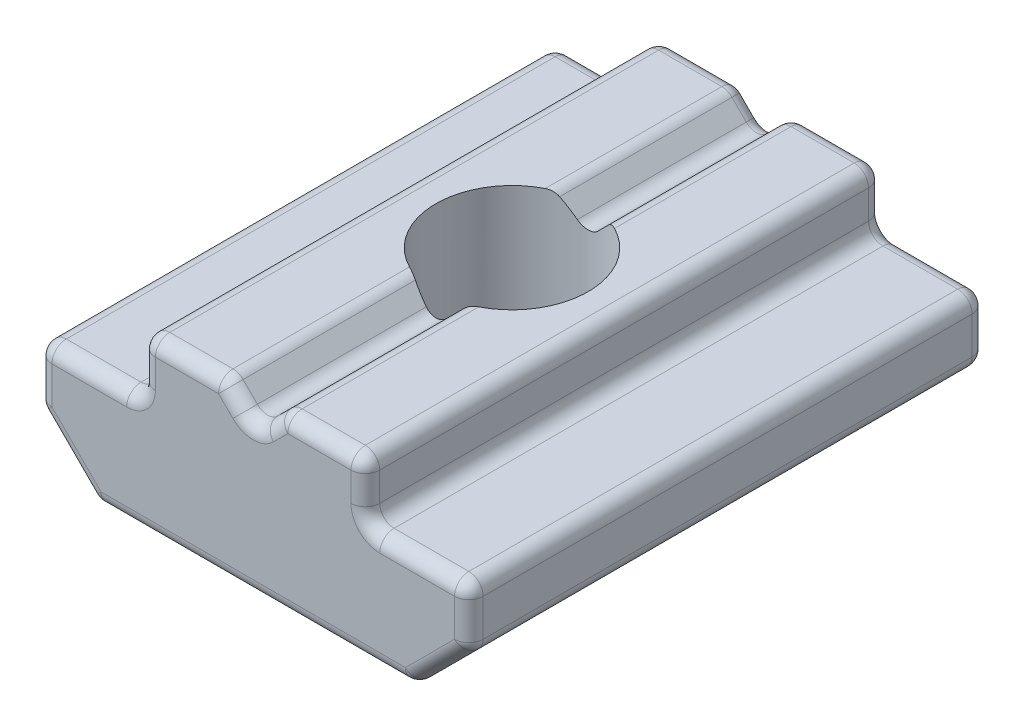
from build123d import *

# Parameters (mm, degrees)
EXTRUDE_1_DEPTH   = 18
FILLET_1_R        = 0.5
HOLE_WIZARD_M51_D = 5.3


with BuildPart() as part:
    # Sketch 1 → Extrude 1 (new body)
    with BuildSketch(Plane.XY):
        Polygon((-7.500000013, 0.999999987), (-7.500000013, -0.999999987), (-5.5, -3), (5.5, -3), (7.500000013, -0.999999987), (7.500000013, 0.999999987), (3.899999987, 0.999999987), (3.899999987, 2.999999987), (0.997020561, 2.999999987), (0, 2.002979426), (-0.997020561, 2.999999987), (-3.900000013, 2.999999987), (-3.900000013, 0.999999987), align=None)
    extrude(amount=EXTRUDE_1_DEPTH)

    # Fillet 1
    fillet_1_edges = [part.edges().sort_by_distance(p)[0] for p in [
        (-6.500000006, -1.999999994, 18),
        (-3.900000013, 1.999999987, 0),
        (-2.448510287, 2.999999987, 0),
        (-0.498510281, 2.501489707, 0),
        (0.498510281, 2.501489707, 0),
        (0, -3, 18),
        (2.448510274, 2.999999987, 0),
        (3.899999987, 1.999999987, 0),
        (5.7, 0.999999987, 0),
        (7.500000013, 0, 0),
        (6.500000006, -1.999999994, 0),
        (0, -3, 0),
        (-6.500000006, -1.999999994, 0),
        (6.500000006, -1.999999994, 18),
        (-7.500000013, 0, 0),
        (-5.700000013, 0.999999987, 0),
        (7.500000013, 0, 18),
        (-3.900000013, 0.999999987, 9),
        (-3.900000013, 2.999999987, 9),
        (-0.997020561, 2.999999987, 9),
        (0, 2.002979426, 9),
        (0.997020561, 2.999999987, 9),
        (3.899999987, 2.999999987, 9),
        (3.899999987, 0.999999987, 9),
        (7.500000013, 0.999999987, 9),
        (7.500000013, -0.999999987, 9),
        (5.5, -3, 9),
        (-5.5, -3, 9),
        (5.7, 0.999999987, 18),
        (-7.500000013, -0.999999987, 9),
        (-7.500000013, 0.999999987, 9),
        (3.899999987, 1.999999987, 18),
        (2.448510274, 2.999999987, 18),
        (0.498510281, 2.501489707, 18),
        (-0.498510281, 2.501489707, 18),
        (-2.448510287, 2.999999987, 18),
        (-5.700000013, 0.999999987, 18),
        (-3.900000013, 1.999999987, 18),
        (-7.500000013, 0, 18),
    ]]
    fillet(fillet_1_edges, radius=FILLET_1_R)

    # Hole Wizard M51 (through all)
    with Locations(Plane(origin=(0, -3, 0), x_dir=(-1, 0, 0), z_dir=(0, -1, 0))):
        with Locations((0, -9)):
            Hole(HOLE_WIZARD_M51_D / 2)


solid = part.part
